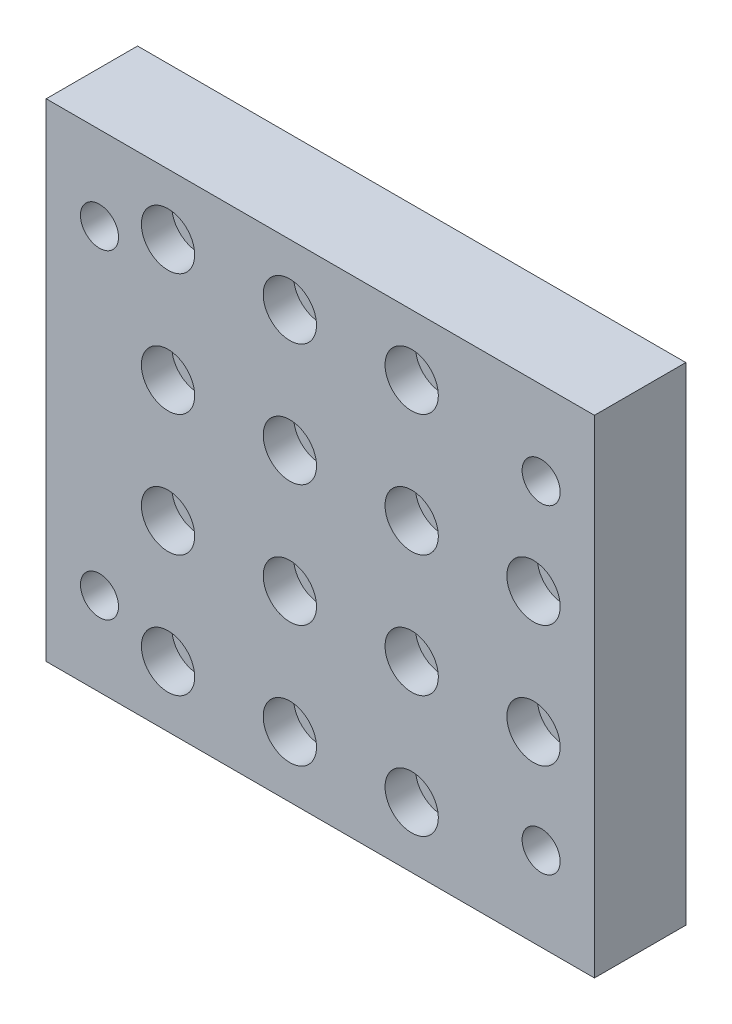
ISO-10303-21;
HEADER;
FILE_DESCRIPTION(('STEP AP214'),'2;1');
FILE_NAME('part.step','',(''),(''),'','','');
FILE_SCHEMA(('AUTOMOTIVE_DESIGN { 1 0 10303 214 1 1 1 1 }'));
ENDSEC;
DATA;
#1=APPLICATION_CONTEXT('core data for automotive mechanical design processes');
#2=APPLICATION_PROTOCOL_DEFINITION('international standard','automotive_design',2000,#1);
#3=PRODUCT_CONTEXT('',#1,'mechanical');
#4=PRODUCT('Part','Part','',(#3));
#5=PRODUCT_RELATED_PRODUCT_CATEGORY('part','',(#4));
#6=PRODUCT_DEFINITION_FORMATION('','',#4);
#7=PRODUCT_DEFINITION_CONTEXT('part definition',#1,'design');
#8=PRODUCT_DEFINITION('design','',#6,#7);
#9=PRODUCT_DEFINITION_SHAPE('','',#8);
#10=(LENGTH_UNIT() NAMED_UNIT(*) SI_UNIT(.MILLI.,.METRE.));
#11=(NAMED_UNIT(*) PLANE_ANGLE_UNIT() SI_UNIT($,.RADIAN.));
#12=(NAMED_UNIT(*) SI_UNIT($,.STERADIAN.) SOLID_ANGLE_UNIT());
#13=UNCERTAINTY_MEASURE_WITH_UNIT(LENGTH_MEASURE(1.E-05),#10,'distance_accuracy_value','');
#14=(GEOMETRIC_REPRESENTATION_CONTEXT(3) GLOBAL_UNCERTAINTY_ASSIGNED_CONTEXT((#13)) GLOBAL_UNIT_ASSIGNED_CONTEXT((#10,
#11,#12)) REPRESENTATION_CONTEXT('',''));
#15=CARTESIAN_POINT('',(0.,0.,0.));
#16=DIRECTION('',(0.,0.,1.));
#17=DIRECTION('',(1.,0.,0.));
#18=AXIS2_PLACEMENT_3D('',#15,#16,#17);
#19=CARTESIAN_POINT('',(-57.15,-50.8,-5.55111512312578E-13));
#20=DIRECTION('',(0.,-1.,0.));
#21=DIRECTION('',(1.,0.,0.));
#22=AXIS2_PLACEMENT_3D('',#19,#20,#21);
#23=PLANE('',#22);
#24=DIRECTION('',(1.,0.,0.));
#25=VECTOR('',#24,1.);
#26=CARTESIAN_POINT('',(-57.15,-50.8,19.049999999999));
#27=LINE('',#26,#25);
#28=CARTESIAN_POINT('',(-57.15,-50.8,19.049999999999));
#29=VERTEX_POINT('',#28);
#30=CARTESIAN_POINT('',(57.15,-50.8,19.049999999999));
#31=VERTEX_POINT('',#30);
#32=EDGE_CURVE('E101',#29,#31,#27,.T.);
#33=ORIENTED_EDGE('',*,*,#32,.F.);
#34=DIRECTION('',(0.,0.,1.));
#35=VECTOR('',#34,1.);
#36=CARTESIAN_POINT('',(-57.15,-50.8,-5.55111512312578E-13));
#37=LINE('',#36,#35);
#38=CARTESIAN_POINT('',(-57.15,-50.8,-5.55111512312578E-13));
#39=VERTEX_POINT('',#38);
#40=EDGE_CURVE('E11',#39,#29,#37,.T.);
#41=ORIENTED_EDGE('',*,*,#40,.F.);
#42=DIRECTION('',(1.,0.,0.));
#43=VECTOR('',#42,1.);
#44=CARTESIAN_POINT('',(-57.15,-50.8,-5.55111512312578E-13));
#45=LINE('',#44,#43);
#46=CARTESIAN_POINT('',(57.15,-50.8,-5.55111512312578E-13));
#47=VERTEX_POINT('',#46);
#48=EDGE_CURVE('E94',#39,#47,#45,.T.);
#49=ORIENTED_EDGE('',*,*,#48,.T.);
#50=DIRECTION('',(0.,0.,1.));
#51=VECTOR('',#50,1.);
#52=CARTESIAN_POINT('',(57.15,-50.8,-5.55111512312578E-13));
#53=LINE('',#52,#51);
#54=EDGE_CURVE('E39',#47,#31,#53,.T.);
#55=ORIENTED_EDGE('',*,*,#54,.T.);
#56=EDGE_LOOP('',(#33,#41,#49,#55));
#57=FACE_BOUND('',#56,.T.);
#58=ADVANCED_FACE('F36',(#57),#23,.T.);
#59=CARTESIAN_POINT('',(-57.15,50.8,-5.55111512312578E-13));
#60=DIRECTION('',(-1.,0.,0.));
#61=DIRECTION('',(0.,-1.,0.));
#62=AXIS2_PLACEMENT_3D('',#59,#60,#61);
#63=PLANE('',#62);
#64=DIRECTION('',(0.,-1.,0.));
#65=VECTOR('',#64,1.);
#66=CARTESIAN_POINT('',(-57.15,50.8,19.0499999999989));
#67=LINE('',#66,#65);
#68=CARTESIAN_POINT('',(-57.15,50.8,19.0499999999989));
#69=VERTEX_POINT('',#68);
#70=EDGE_CURVE('E96',#69,#29,#67,.T.);
#71=ORIENTED_EDGE('',*,*,#70,.F.);
#72=DIRECTION('',(0.,0.,1.));
#73=VECTOR('',#72,1.);
#74=CARTESIAN_POINT('',(-57.15,50.8,-5.55111512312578E-13));
#75=LINE('',#74,#73);
#76=CARTESIAN_POINT('',(-57.15,50.8,-5.55111512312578E-13));
#77=VERTEX_POINT('',#76);
#78=EDGE_CURVE('E45',#77,#69,#75,.T.);
#79=ORIENTED_EDGE('',*,*,#78,.F.);
#80=DIRECTION('',(0.,-1.,0.));
#81=VECTOR('',#80,1.);
#82=CARTESIAN_POINT('',(-57.15,50.8,-5.55111512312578E-13));
#83=LINE('',#82,#81);
#84=EDGE_CURVE('E91',#77,#39,#83,.T.);
#85=ORIENTED_EDGE('',*,*,#84,.T.);
#86=ORIENTED_EDGE('',*,*,#40,.T.);
#87=EDGE_LOOP('',(#71,#79,#85,#86));
#88=FACE_BOUND('',#87,.T.);
#89=ADVANCED_FACE('F112',(#88),#63,.T.);
#90=CARTESIAN_POINT('',(57.15,50.8,-5.55111512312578E-13));
#91=DIRECTION('',(0.,1.,0.));
#92=DIRECTION('',(-1.,0.,0.));
#93=AXIS2_PLACEMENT_3D('',#90,#91,#92);
#94=PLANE('',#93);
#95=DIRECTION('',(-1.,0.,0.));
#96=VECTOR('',#95,1.);
#97=CARTESIAN_POINT('',(57.15,50.8,19.0499999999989));
#98=LINE('',#97,#96);
#99=CARTESIAN_POINT('',(57.15,50.8,19.0499999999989));
#100=VERTEX_POINT('',#99);
#101=EDGE_CURVE('E86',#100,#69,#98,.T.);
#102=ORIENTED_EDGE('',*,*,#101,.F.);
#103=DIRECTION('',(0.,0.,1.));
#104=VECTOR('',#103,1.);
#105=CARTESIAN_POINT('',(57.15,50.8,-5.55111512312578E-13));
#106=LINE('',#105,#104);
#107=CARTESIAN_POINT('',(57.15,50.8,-5.55111512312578E-13));
#108=VERTEX_POINT('',#107);
#109=EDGE_CURVE('E81',#108,#100,#106,.T.);
#110=ORIENTED_EDGE('',*,*,#109,.F.);
#111=DIRECTION('',(-1.,0.,0.));
#112=VECTOR('',#111,1.);
#113=CARTESIAN_POINT('',(57.15,50.8,-5.55111512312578E-13));
#114=LINE('',#113,#112);
#115=EDGE_CURVE('E84',#108,#77,#114,.T.);
#116=ORIENTED_EDGE('',*,*,#115,.T.);
#117=ORIENTED_EDGE('',*,*,#78,.T.);
#118=EDGE_LOOP('',(#102,#110,#116,#117));
#119=FACE_BOUND('',#118,.T.);
#120=ADVANCED_FACE('F83',(#119),#94,.T.);
#121=CARTESIAN_POINT('',(57.15,-50.8,-5.55111512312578E-13));
#122=DIRECTION('',(1.,0.,0.));
#123=DIRECTION('',(0.,0.,-1.));
#124=AXIS2_PLACEMENT_3D('',#121,#122,#123);
#125=PLANE('',#124);
#126=DIRECTION('',(0.,1.,0.));
#127=VECTOR('',#126,1.);
#128=CARTESIAN_POINT('',(57.15,-50.8,19.049999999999));
#129=LINE('',#128,#127);
#130=EDGE_CURVE('E104',#31,#100,#129,.T.);
#131=ORIENTED_EDGE('',*,*,#130,.F.);
#132=ORIENTED_EDGE('',*,*,#54,.F.);
#133=DIRECTION('',(0.,1.,0.));
#134=VECTOR('',#133,1.);
#135=CARTESIAN_POINT('',(57.15,-50.8,-5.55111512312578E-13));
#136=LINE('',#135,#134);
#137=EDGE_CURVE('E90',#47,#108,#136,.T.);
#138=ORIENTED_EDGE('',*,*,#137,.T.);
#139=ORIENTED_EDGE('',*,*,#109,.T.);
#140=EDGE_LOOP('',(#131,#132,#138,#139));
#141=FACE_BOUND('',#140,.T.);
#142=ADVANCED_FACE('F93',(#141),#125,.T.);
#143=CARTESIAN_POINT('',(0.,0.,0.));
#144=DIRECTION('',(0.,0.,1.));
#145=DIRECTION('',(1.,0.,0.));
#146=AXIS2_PLACEMENT_3D('',#143,#144,#145);
#147=PLANE('',#146);
#148=CARTESIAN_POINT('',(-31.75,38.1,-5.55111512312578E-13));
#149=DIRECTION('',(0.,0.,1.));
#150=DIRECTION('',(1.,0.,0.));
#151=AXIS2_PLACEMENT_3D('',#148,#149,#150);
#152=CIRCLE('',#151,3.26389999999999);
#153=CARTESIAN_POINT('',(-28.4861,38.1,-5.55111512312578E-13));
#154=VERTEX_POINT('',#153);
#155=EDGE_CURVE('E332',#154,#154,#152,.T.);
#156=ORIENTED_EDGE('',*,*,#155,.T.);
#157=EDGE_LOOP('',(#156));
#158=FACE_BOUND('',#157,.T.);
#159=CARTESIAN_POINT('',(-6.35000000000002,38.1,-5.55111512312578E-13));
#160=DIRECTION('',(0.,0.,1.));
#161=DIRECTION('',(1.,0.,0.));
#162=AXIS2_PLACEMENT_3D('',#159,#160,#161);
#163=CIRCLE('',#162,3.2639);
#164=CARTESIAN_POINT('',(-3.08610000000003,38.1,-5.55111512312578E-13));
#165=VERTEX_POINT('',#164);
#166=EDGE_CURVE('E343',#165,#165,#163,.T.);
#167=ORIENTED_EDGE('',*,*,#166,.T.);
#168=EDGE_LOOP('',(#167));
#169=FACE_BOUND('',#168,.T.);
#170=CARTESIAN_POINT('',(19.05,38.1,-5.55111512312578E-13));
#171=DIRECTION('',(0.,0.,1.));
#172=DIRECTION('',(1.,0.,0.));
#173=AXIS2_PLACEMENT_3D('',#170,#171,#172);
#174=CIRCLE('',#173,3.26389999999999);
#175=CARTESIAN_POINT('',(22.3139,38.1,-5.55111512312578E-13));
#176=VERTEX_POINT('',#175);
#177=EDGE_CURVE('E355',#176,#176,#174,.T.);
#178=ORIENTED_EDGE('',*,*,#177,.T.);
#179=EDGE_LOOP('',(#178));
#180=FACE_BOUND('',#179,.T.);
#181=CARTESIAN_POINT('',(-31.75,12.7,0.));
#182=DIRECTION('',(0.,0.,1.));
#183=DIRECTION('',(1.,0.,0.));
#184=AXIS2_PLACEMENT_3D('',#181,#182,#183);
#185=CIRCLE('',#184,3.26389999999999);
#186=CARTESIAN_POINT('',(-28.4861,12.7,0.));
#187=VERTEX_POINT('',#186);
#188=EDGE_CURVE('E367',#187,#187,#185,.T.);
#189=ORIENTED_EDGE('',*,*,#188,.T.);
#190=EDGE_LOOP('',(#189));
#191=FACE_BOUND('',#190,.T.);
#192=CARTESIAN_POINT('',(-6.34999999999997,12.7,0.));
#193=DIRECTION('',(0.,0.,1.));
#194=DIRECTION('',(1.,0.,0.));
#195=AXIS2_PLACEMENT_3D('',#192,#193,#194);
#196=CIRCLE('',#195,3.2639);
#197=CARTESIAN_POINT('',(-3.08609999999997,12.7,0.));
#198=VERTEX_POINT('',#197);
#199=EDGE_CURVE('E379',#198,#198,#196,.T.);
#200=ORIENTED_EDGE('',*,*,#199,.T.);
#201=EDGE_LOOP('',(#200));
#202=FACE_BOUND('',#201,.T.);
#203=CARTESIAN_POINT('',(19.05,12.6999999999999,0.));
#204=DIRECTION('',(0.,0.,1.));
#205=DIRECTION('',(1.,0.,0.));
#206=AXIS2_PLACEMENT_3D('',#203,#204,#205);
#207=CIRCLE('',#206,3.26389999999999);
#208=CARTESIAN_POINT('',(22.3139,12.6999999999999,0.));
#209=VERTEX_POINT('',#208);
#210=EDGE_CURVE('E391',#209,#209,#207,.T.);
#211=ORIENTED_EDGE('',*,*,#210,.T.);
#212=EDGE_LOOP('',(#211));
#213=FACE_BOUND('',#212,.T.);
#214=CARTESIAN_POINT('',(-31.75,-12.7,0.));
#215=DIRECTION('',(0.,0.,1.));
#216=DIRECTION('',(1.,0.,0.));
#217=AXIS2_PLACEMENT_3D('',#214,#215,#216);
#218=CIRCLE('',#217,3.26389999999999);
#219=CARTESIAN_POINT('',(-28.4861,-12.7,0.));
#220=VERTEX_POINT('',#219);
#221=EDGE_CURVE('E403',#220,#220,#218,.T.);
#222=ORIENTED_EDGE('',*,*,#221,.T.);
#223=EDGE_LOOP('',(#222));
#224=FACE_BOUND('',#223,.T.);
#225=CARTESIAN_POINT('',(-6.35000000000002,-12.7,0.));
#226=DIRECTION('',(0.,0.,1.));
#227=DIRECTION('',(1.,0.,0.));
#228=AXIS2_PLACEMENT_3D('',#225,#226,#227);
#229=CIRCLE('',#228,3.2639);
#230=CARTESIAN_POINT('',(-3.08610000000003,-12.7,0.));
#231=VERTEX_POINT('',#230);
#232=EDGE_CURVE('E415',#231,#231,#229,.T.);
#233=ORIENTED_EDGE('',*,*,#232,.T.);
#234=EDGE_LOOP('',(#233));
#235=FACE_BOUND('',#234,.T.);
#236=CARTESIAN_POINT('',(-31.75,-38.1,-5.55111512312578E-13));
#237=DIRECTION('',(0.,0.,1.));
#238=DIRECTION('',(1.,0.,0.));
#239=AXIS2_PLACEMENT_3D('',#236,#237,#238);
#240=CIRCLE('',#239,3.26389999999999);
#241=CARTESIAN_POINT('',(-28.4861,-38.1,-5.55111512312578E-13));
#242=VERTEX_POINT('',#241);
#243=EDGE_CURVE('E427',#242,#242,#240,.T.);
#244=ORIENTED_EDGE('',*,*,#243,.T.);
#245=EDGE_LOOP('',(#244));
#246=FACE_BOUND('',#245,.T.);
#247=CARTESIAN_POINT('',(-6.34999999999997,-38.1,-5.55111512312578E-13));
#248=DIRECTION('',(0.,0.,1.));
#249=DIRECTION('',(1.,0.,0.));
#250=AXIS2_PLACEMENT_3D('',#247,#248,#249);
#251=CIRCLE('',#250,3.2639);
#252=CARTESIAN_POINT('',(-3.08609999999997,-38.1,-5.55111512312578E-13));
#253=VERTEX_POINT('',#252);
#254=EDGE_CURVE('E439',#253,#253,#251,.T.);
#255=ORIENTED_EDGE('',*,*,#254,.T.);
#256=EDGE_LOOP('',(#255));
#257=FACE_BOUND('',#256,.T.);
#258=CARTESIAN_POINT('',(44.45,12.7,0.));
#259=DIRECTION('',(0.,0.,1.));
#260=DIRECTION('',(1.,0.,0.));
#261=AXIS2_PLACEMENT_3D('',#258,#259,#260);
#262=CIRCLE('',#261,3.26389999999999);
#263=CARTESIAN_POINT('',(47.7139,12.7,0.));
#264=VERTEX_POINT('',#263);
#265=EDGE_CURVE('E451',#264,#264,#262,.T.);
#266=ORIENTED_EDGE('',*,*,#265,.T.);
#267=EDGE_LOOP('',(#266));
#268=FACE_BOUND('',#267,.T.);
#269=CARTESIAN_POINT('',(19.05,-12.7000000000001,0.));
#270=DIRECTION('',(0.,0.,1.));
#271=DIRECTION('',(1.,0.,0.));
#272=AXIS2_PLACEMENT_3D('',#269,#270,#271);
#273=CIRCLE('',#272,3.26389999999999);
#274=CARTESIAN_POINT('',(22.3139,-12.7000000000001,0.));
#275=VERTEX_POINT('',#274);
#276=EDGE_CURVE('E463',#275,#275,#273,.T.);
#277=ORIENTED_EDGE('',*,*,#276,.T.);
#278=EDGE_LOOP('',(#277));
#279=FACE_BOUND('',#278,.T.);
#280=CARTESIAN_POINT('',(44.45,-12.7,0.));
#281=DIRECTION('',(0.,0.,1.));
#282=DIRECTION('',(1.,0.,0.));
#283=AXIS2_PLACEMENT_3D('',#280,#281,#282);
#284=CIRCLE('',#283,3.26389999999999);
#285=CARTESIAN_POINT('',(47.7139,-12.7,0.));
#286=VERTEX_POINT('',#285);
#287=EDGE_CURVE('E475',#286,#286,#284,.T.);
#288=ORIENTED_EDGE('',*,*,#287,.T.);
#289=EDGE_LOOP('',(#288));
#290=FACE_BOUND('',#289,.T.);
#291=CARTESIAN_POINT('',(19.05,-38.1000000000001,-5.55111512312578E-13));
#292=DIRECTION('',(0.,0.,1.));
#293=DIRECTION('',(1.,0.,0.));
#294=AXIS2_PLACEMENT_3D('',#291,#292,#293);
#295=CIRCLE('',#294,3.26389999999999);
#296=CARTESIAN_POINT('',(22.3139,-38.1000000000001,-5.55111512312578E-13));
#297=VERTEX_POINT('',#296);
#298=EDGE_CURVE('E487',#297,#297,#295,.T.);
#299=ORIENTED_EDGE('',*,*,#298,.T.);
#300=EDGE_LOOP('',(#299));
#301=FACE_BOUND('',#300,.T.);
#302=CARTESIAN_POINT('',(-46.0375,33.3375,-5.55111512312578E-13));
#303=DIRECTION('',(0.,0.,1.));
#304=DIRECTION('',(1.,0.,0.));
#305=AXIS2_PLACEMENT_3D('',#302,#303,#304);
#306=CIRCLE('',#305,3.96874999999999);
#307=CARTESIAN_POINT('',(-42.06875,33.3375,-5.55111512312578E-13));
#308=VERTEX_POINT('',#307);
#309=EDGE_CURVE('E493',#308,#308,#306,.T.);
#310=ORIENTED_EDGE('',*,*,#309,.T.);
#311=EDGE_LOOP('',(#310));
#312=FACE_BOUND('',#311,.T.);
#313=CARTESIAN_POINT('',(46.0375,33.3375,-5.55111512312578E-13));
#314=DIRECTION('',(0.,0.,1.));
#315=DIRECTION('',(1.,0.,0.));
#316=AXIS2_PLACEMENT_3D('',#313,#314,#315);
#317=CIRCLE('',#316,3.96874999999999);
#318=CARTESIAN_POINT('',(50.0062499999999,33.3375,-5.55111512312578E-13));
#319=VERTEX_POINT('',#318);
#320=EDGE_CURVE('E499',#319,#319,#317,.T.);
#321=ORIENTED_EDGE('',*,*,#320,.T.);
#322=EDGE_LOOP('',(#321));
#323=FACE_BOUND('',#322,.T.);
#324=CARTESIAN_POINT('',(46.0375,-33.3375,-5.55111512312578E-13));
#325=DIRECTION('',(0.,0.,1.));
#326=DIRECTION('',(1.,0.,0.));
#327=AXIS2_PLACEMENT_3D('',#324,#325,#326);
#328=CIRCLE('',#327,3.96874999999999);
#329=CARTESIAN_POINT('',(50.00625,-33.3375,-5.55111512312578E-13));
#330=VERTEX_POINT('',#329);
#331=EDGE_CURVE('E505',#330,#330,#328,.T.);
#332=ORIENTED_EDGE('',*,*,#331,.T.);
#333=EDGE_LOOP('',(#332));
#334=FACE_BOUND('',#333,.T.);
#335=CARTESIAN_POINT('',(-46.0375,-33.3375,-5.55111512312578E-13));
#336=DIRECTION('',(0.,0.,1.));
#337=DIRECTION('',(1.,0.,0.));
#338=AXIS2_PLACEMENT_3D('',#335,#336,#337);
#339=CIRCLE('',#338,3.96874999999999);
#340=CARTESIAN_POINT('',(-42.06875,-33.3375,-5.55111512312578E-13));
#341=VERTEX_POINT('',#340);
#342=EDGE_CURVE('E105',#341,#341,#339,.T.);
#343=ORIENTED_EDGE('',*,*,#342,.T.);
#344=EDGE_LOOP('',(#343));
#345=FACE_BOUND('',#344,.T.);
#346=ORIENTED_EDGE('',*,*,#48,.F.);
#347=ORIENTED_EDGE('',*,*,#84,.F.);
#348=ORIENTED_EDGE('',*,*,#115,.F.);
#349=ORIENTED_EDGE('',*,*,#137,.F.);
#350=EDGE_LOOP('',(#346,#347,#348,#349));
#351=FACE_BOUND('',#350,.T.);
#352=ADVANCED_FACE('F89',(#158,#169,#180,#191,#202,#213,#224,#235,#246,#257,#268,#279,#290,#301,
#312,#323,#334,#345,#351),#147,.F.);
#353=CARTESIAN_POINT('',(0.,0.,19.05));
#354=DIRECTION('',(0.,0.,1.));
#355=DIRECTION('',(1.,0.,0.));
#356=AXIS2_PLACEMENT_3D('',#353,#354,#355);
#357=PLANE('',#356);
#358=CARTESIAN_POINT('',(-31.75,38.1,19.0499999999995));
#359=DIRECTION('',(0.,0.,1.));
#360=DIRECTION('',(1.,0.,0.));
#361=AXIS2_PLACEMENT_3D('',#358,#359,#360);
#362=CIRCLE('',#361,5.55625);
#363=CARTESIAN_POINT('',(-26.19375,38.1,19.0499999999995));
#364=VERTEX_POINT('',#363);
#365=EDGE_CURVE('E325',#364,#364,#362,.T.);
#366=ORIENTED_EDGE('',*,*,#365,.F.);
#367=EDGE_LOOP('',(#366));
#368=FACE_BOUND('',#367,.T.);
#369=CARTESIAN_POINT('',(-6.35000000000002,38.1,19.0499999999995));
#370=DIRECTION('',(0.,0.,1.));
#371=DIRECTION('',(1.,0.,0.));
#372=AXIS2_PLACEMENT_3D('',#369,#370,#371);
#373=CIRCLE('',#372,5.55625);
#374=CARTESIAN_POINT('',(-0.793750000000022,38.1,19.0499999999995));
#375=VERTEX_POINT('',#374);
#376=EDGE_CURVE('E334',#375,#375,#373,.T.);
#377=ORIENTED_EDGE('',*,*,#376,.F.);
#378=EDGE_LOOP('',(#377));
#379=FACE_BOUND('',#378,.T.);
#380=CARTESIAN_POINT('',(19.05,38.0999999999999,19.0499999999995));
#381=DIRECTION('',(0.,0.,1.));
#382=DIRECTION('',(1.,0.,0.));
#383=AXIS2_PLACEMENT_3D('',#380,#381,#382);
#384=CIRCLE('',#383,5.55625);
#385=CARTESIAN_POINT('',(24.60625,38.0999999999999,19.0499999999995));
#386=VERTEX_POINT('',#385);
#387=EDGE_CURVE('E346',#386,#386,#384,.T.);
#388=ORIENTED_EDGE('',*,*,#387,.F.);
#389=EDGE_LOOP('',(#388));
#390=FACE_BOUND('',#389,.T.);
#391=CARTESIAN_POINT('',(-31.75,12.7,19.05));
#392=DIRECTION('',(0.,0.,1.));
#393=DIRECTION('',(1.,0.,0.));
#394=AXIS2_PLACEMENT_3D('',#391,#392,#393);
#395=CIRCLE('',#394,5.55625);
#396=CARTESIAN_POINT('',(-26.19375,12.7,19.05));
#397=VERTEX_POINT('',#396);
#398=EDGE_CURVE('E358',#397,#397,#395,.T.);
#399=ORIENTED_EDGE('',*,*,#398,.F.);
#400=EDGE_LOOP('',(#399));
#401=FACE_BOUND('',#400,.T.);
#402=CARTESIAN_POINT('',(-6.34999999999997,12.6999999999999,19.05));
#403=DIRECTION('',(0.,0.,1.));
#404=DIRECTION('',(1.,0.,0.));
#405=AXIS2_PLACEMENT_3D('',#402,#403,#404);
#406=CIRCLE('',#405,5.55625);
#407=CARTESIAN_POINT('',(-0.793749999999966,12.6999999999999,19.05));
#408=VERTEX_POINT('',#407);
#409=EDGE_CURVE('E370',#408,#408,#406,.T.);
#410=ORIENTED_EDGE('',*,*,#409,.F.);
#411=EDGE_LOOP('',(#410));
#412=FACE_BOUND('',#411,.T.);
#413=CARTESIAN_POINT('',(19.05,12.7,19.05));
#414=DIRECTION('',(0.,0.,1.));
#415=DIRECTION('',(1.,0.,0.));
#416=AXIS2_PLACEMENT_3D('',#413,#414,#415);
#417=CIRCLE('',#416,5.55625);
#418=CARTESIAN_POINT('',(24.60625,12.7,19.05));
#419=VERTEX_POINT('',#418);
#420=EDGE_CURVE('E382',#419,#419,#417,.T.);
#421=ORIENTED_EDGE('',*,*,#420,.F.);
#422=EDGE_LOOP('',(#421));
#423=FACE_BOUND('',#422,.T.);
#424=CARTESIAN_POINT('',(-31.75,-12.7,19.05));
#425=DIRECTION('',(0.,0.,1.));
#426=DIRECTION('',(1.,0.,0.));
#427=AXIS2_PLACEMENT_3D('',#424,#425,#426);
#428=CIRCLE('',#427,5.55625);
#429=CARTESIAN_POINT('',(-26.19375,-12.7,19.05));
#430=VERTEX_POINT('',#429);
#431=EDGE_CURVE('E394',#430,#430,#428,.T.);
#432=ORIENTED_EDGE('',*,*,#431,.F.);
#433=EDGE_LOOP('',(#432));
#434=FACE_BOUND('',#433,.T.);
#435=CARTESIAN_POINT('',(-6.35000000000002,-12.7000000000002,19.05));
#436=DIRECTION('',(0.,0.,1.));
#437=DIRECTION('',(1.,0.,0.));
#438=AXIS2_PLACEMENT_3D('',#435,#436,#437);
#439=CIRCLE('',#438,5.55625);
#440=CARTESIAN_POINT('',(-0.793750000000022,-12.7000000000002,19.05));
#441=VERTEX_POINT('',#440);
#442=EDGE_CURVE('E406',#441,#441,#439,.T.);
#443=ORIENTED_EDGE('',*,*,#442,.F.);
#444=EDGE_LOOP('',(#443));
#445=FACE_BOUND('',#444,.T.);
#446=CARTESIAN_POINT('',(-31.75,-38.1000000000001,19.0499999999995));
#447=DIRECTION('',(0.,0.,1.));
#448=DIRECTION('',(1.,0.,0.));
#449=AXIS2_PLACEMENT_3D('',#446,#447,#448);
#450=CIRCLE('',#449,5.55625);
#451=CARTESIAN_POINT('',(-26.19375,-38.1000000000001,19.0499999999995));
#452=VERTEX_POINT('',#451);
#453=EDGE_CURVE('E418',#452,#452,#450,.T.);
#454=ORIENTED_EDGE('',*,*,#453,.F.);
#455=EDGE_LOOP('',(#454));
#456=FACE_BOUND('',#455,.T.);
#457=CARTESIAN_POINT('',(-6.34999999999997,-38.1,19.0499999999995));
#458=DIRECTION('',(0.,0.,1.));
#459=DIRECTION('',(1.,0.,0.));
#460=AXIS2_PLACEMENT_3D('',#457,#458,#459);
#461=CIRCLE('',#460,5.55625);
#462=CARTESIAN_POINT('',(-0.793749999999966,-38.1,19.0499999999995));
#463=VERTEX_POINT('',#462);
#464=EDGE_CURVE('E430',#463,#463,#461,.T.);
#465=ORIENTED_EDGE('',*,*,#464,.F.);
#466=EDGE_LOOP('',(#465));
#467=FACE_BOUND('',#466,.T.);
#468=CARTESIAN_POINT('',(44.45,12.6999999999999,19.05));
#469=DIRECTION('',(0.,0.,1.));
#470=DIRECTION('',(1.,0.,0.));
#471=AXIS2_PLACEMENT_3D('',#468,#469,#470);
#472=CIRCLE('',#471,5.55625);
#473=CARTESIAN_POINT('',(50.00625,12.6999999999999,19.05));
#474=VERTEX_POINT('',#473);
#475=EDGE_CURVE('E442',#474,#474,#472,.T.);
#476=ORIENTED_EDGE('',*,*,#475,.F.);
#477=EDGE_LOOP('',(#476));
#478=FACE_BOUND('',#477,.T.);
#479=CARTESIAN_POINT('',(19.05,-12.7,19.05));
#480=DIRECTION('',(0.,0.,1.));
#481=DIRECTION('',(1.,0.,0.));
#482=AXIS2_PLACEMENT_3D('',#479,#480,#481);
#483=CIRCLE('',#482,5.55625);
#484=CARTESIAN_POINT('',(24.60625,-12.7,19.05));
#485=VERTEX_POINT('',#484);
#486=EDGE_CURVE('E454',#485,#485,#483,.T.);
#487=ORIENTED_EDGE('',*,*,#486,.F.);
#488=EDGE_LOOP('',(#487));
#489=FACE_BOUND('',#488,.T.);
#490=CARTESIAN_POINT('',(44.45,-12.7000000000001,19.05));
#491=DIRECTION('',(0.,0.,1.));
#492=DIRECTION('',(1.,0.,0.));
#493=AXIS2_PLACEMENT_3D('',#490,#491,#492);
#494=CIRCLE('',#493,5.55625);
#495=CARTESIAN_POINT('',(50.00625,-12.7000000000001,19.05));
#496=VERTEX_POINT('',#495);
#497=EDGE_CURVE('E466',#496,#496,#494,.T.);
#498=ORIENTED_EDGE('',*,*,#497,.F.);
#499=EDGE_LOOP('',(#498));
#500=FACE_BOUND('',#499,.T.);
#501=CARTESIAN_POINT('',(19.05,-38.0999999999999,19.0499999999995));
#502=DIRECTION('',(0.,0.,1.));
#503=DIRECTION('',(1.,0.,0.));
#504=AXIS2_PLACEMENT_3D('',#501,#502,#503);
#505=CIRCLE('',#504,5.55625);
#506=CARTESIAN_POINT('',(24.60625,-38.0999999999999,19.0499999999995));
#507=VERTEX_POINT('',#506);
#508=EDGE_CURVE('E478',#507,#507,#505,.T.);
#509=ORIENTED_EDGE('',*,*,#508,.F.);
#510=EDGE_LOOP('',(#509));
#511=FACE_BOUND('',#510,.T.);
#512=CARTESIAN_POINT('',(-46.0375,33.3375,19.0499999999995));
#513=DIRECTION('',(0.,0.,1.));
#514=DIRECTION('',(1.,0.,0.));
#515=AXIS2_PLACEMENT_3D('',#512,#513,#514);
#516=CIRCLE('',#515,3.96874999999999);
#517=CARTESIAN_POINT('',(-42.06875,33.3375,19.0499999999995));
#518=VERTEX_POINT('',#517);
#519=EDGE_CURVE('E490',#518,#518,#516,.T.);
#520=ORIENTED_EDGE('',*,*,#519,.F.);
#521=EDGE_LOOP('',(#520));
#522=FACE_BOUND('',#521,.T.);
#523=CARTESIAN_POINT('',(46.0375,33.3375,19.0499999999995));
#524=DIRECTION('',(0.,0.,1.));
#525=DIRECTION('',(1.,0.,0.));
#526=AXIS2_PLACEMENT_3D('',#523,#524,#525);
#527=CIRCLE('',#526,3.96874999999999);
#528=CARTESIAN_POINT('',(50.0062499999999,33.3375,19.0499999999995));
#529=VERTEX_POINT('',#528);
#530=EDGE_CURVE('E496',#529,#529,#527,.T.);
#531=ORIENTED_EDGE('',*,*,#530,.F.);
#532=EDGE_LOOP('',(#531));
#533=FACE_BOUND('',#532,.T.);
#534=CARTESIAN_POINT('',(46.0375,-33.3375,19.0499999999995));
#535=DIRECTION('',(0.,0.,1.));
#536=DIRECTION('',(1.,0.,0.));
#537=AXIS2_PLACEMENT_3D('',#534,#535,#536);
#538=CIRCLE('',#537,3.96874999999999);
#539=CARTESIAN_POINT('',(50.00625,-33.3375,19.0499999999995));
#540=VERTEX_POINT('',#539);
#541=EDGE_CURVE('E502',#540,#540,#538,.T.);
#542=ORIENTED_EDGE('',*,*,#541,.F.);
#543=EDGE_LOOP('',(#542));
#544=FACE_BOUND('',#543,.T.);
#545=CARTESIAN_POINT('',(-46.0375,-33.3375,19.0499999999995));
#546=DIRECTION('',(0.,0.,1.));
#547=DIRECTION('',(1.,0.,0.));
#548=AXIS2_PLACEMENT_3D('',#545,#546,#547);
#549=CIRCLE('',#548,3.96874999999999);
#550=CARTESIAN_POINT('',(-42.06875,-33.3375,19.0499999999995));
#551=VERTEX_POINT('',#550);
#552=EDGE_CURVE('E508',#551,#551,#549,.T.);
#553=ORIENTED_EDGE('',*,*,#552,.F.);
#554=EDGE_LOOP('',(#553));
#555=FACE_BOUND('',#554,.T.);
#556=ORIENTED_EDGE('',*,*,#32,.T.);
#557=ORIENTED_EDGE('',*,*,#130,.T.);
#558=ORIENTED_EDGE('',*,*,#101,.T.);
#559=ORIENTED_EDGE('',*,*,#70,.T.);
#560=EDGE_LOOP('',(#556,#557,#558,#559));
#561=FACE_BOUND('',#560,.T.);
#562=ADVANCED_FACE('F111',(#368,#379,#390,#401,#412,#423,#434,#445,#456,#467,#478,#489,#500,
#511,#522,#533,#544,#555,#561),#357,.T.);
#563=CARTESIAN_POINT('',(-46.0375,-33.3375,19.0499999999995));
#564=DIRECTION('',(0.,0.,1.));
#565=DIRECTION('',(1.,0.,0.));
#566=AXIS2_PLACEMENT_3D('',#563,#564,#565);
#567=CYLINDRICAL_SURFACE('',#566,3.96874999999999);
#568=ORIENTED_EDGE('',*,*,#342,.F.);
#569=EDGE_LOOP('',(#568));
#570=FACE_BOUND('',#569,.T.);
#571=ORIENTED_EDGE('',*,*,#552,.T.);
#572=EDGE_LOOP('',(#571));
#573=FACE_BOUND('',#572,.T.);
#574=ADVANCED_FACE('F130',(#570,#573),#567,.F.);
#575=CARTESIAN_POINT('',(46.0375,-33.3375,19.0499999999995));
#576=DIRECTION('',(0.,0.,1.));
#577=DIRECTION('',(1.,0.,0.));
#578=AXIS2_PLACEMENT_3D('',#575,#576,#577);
#579=CYLINDRICAL_SURFACE('',#578,3.96874999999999);
#580=ORIENTED_EDGE('',*,*,#331,.F.);
#581=EDGE_LOOP('',(#580));
#582=FACE_BOUND('',#581,.T.);
#583=ORIENTED_EDGE('',*,*,#541,.T.);
#584=EDGE_LOOP('',(#583));
#585=FACE_BOUND('',#584,.T.);
#586=ADVANCED_FACE('F137',(#582,#585),#579,.F.);
#587=CARTESIAN_POINT('',(46.0375,33.3375,19.0499999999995));
#588=DIRECTION('',(0.,0.,1.));
#589=DIRECTION('',(1.,0.,0.));
#590=AXIS2_PLACEMENT_3D('',#587,#588,#589);
#591=CYLINDRICAL_SURFACE('',#590,3.96874999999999);
#592=ORIENTED_EDGE('',*,*,#320,.F.);
#593=EDGE_LOOP('',(#592));
#594=FACE_BOUND('',#593,.T.);
#595=ORIENTED_EDGE('',*,*,#530,.T.);
#596=EDGE_LOOP('',(#595));
#597=FACE_BOUND('',#596,.T.);
#598=ADVANCED_FACE('F141',(#594,#597),#591,.F.);
#599=CARTESIAN_POINT('',(-46.0375,33.3375,19.0499999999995));
#600=DIRECTION('',(0.,0.,1.));
#601=DIRECTION('',(1.,0.,0.));
#602=AXIS2_PLACEMENT_3D('',#599,#600,#601);
#603=CYLINDRICAL_SURFACE('',#602,3.96874999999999);
#604=ORIENTED_EDGE('',*,*,#309,.F.);
#605=EDGE_LOOP('',(#604));
#606=FACE_BOUND('',#605,.T.);
#607=ORIENTED_EDGE('',*,*,#519,.T.);
#608=EDGE_LOOP('',(#607));
#609=FACE_BOUND('',#608,.T.);
#610=ADVANCED_FACE('F145',(#606,#609),#603,.F.);
#611=CARTESIAN_POINT('',(19.05,-38.0999999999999,19.0499999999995));
#612=DIRECTION('',(0.,0.,1.));
#613=DIRECTION('',(1.,0.,0.));
#614=AXIS2_PLACEMENT_3D('',#611,#612,#613);
#615=CYLINDRICAL_SURFACE('',#614,3.2639);
#616=ORIENTED_EDGE('',*,*,#298,.F.);
#617=EDGE_LOOP('',(#616));
#618=FACE_BOUND('',#617,.T.);
#619=CARTESIAN_POINT('',(19.05,-38.1,12.6999999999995));
#620=DIRECTION('',(0.,0.,1.));
#621=DIRECTION('',(1.,0.,0.));
#622=AXIS2_PLACEMENT_3D('',#619,#620,#621);
#623=CIRCLE('',#622,3.2639);
#624=CARTESIAN_POINT('',(22.3139,-38.1,12.6999999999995));
#625=VERTEX_POINT('',#624);
#626=EDGE_CURVE('E484',#625,#625,#623,.T.);
#627=ORIENTED_EDGE('',*,*,#626,.T.);
#628=EDGE_LOOP('',(#627));
#629=FACE_BOUND('',#628,.T.);
#630=ADVANCED_FACE('F149',(#618,#629),#615,.F.);
#631=CARTESIAN_POINT('',(22.3139,-38.1000000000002,12.6999999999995));
#632=DIRECTION('',(0.,0.,-1.));
#633=DIRECTION('',(-1.,0.,0.));
#634=AXIS2_PLACEMENT_3D('',#631,#632,#633);
#635=PLANE('',#634);
#636=ORIENTED_EDGE('',*,*,#626,.F.);
#637=EDGE_LOOP('',(#636));
#638=FACE_BOUND('',#637,.T.);
#639=CARTESIAN_POINT('',(19.05,-38.1,12.6999999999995));
#640=DIRECTION('',(0.,0.,1.));
#641=DIRECTION('',(1.,0.,0.));
#642=AXIS2_PLACEMENT_3D('',#639,#640,#641);
#643=CIRCLE('',#642,5.55625);
#644=CARTESIAN_POINT('',(24.60625,-38.1,12.6999999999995));
#645=VERTEX_POINT('',#644);
#646=EDGE_CURVE('E481',#645,#645,#643,.T.);
#647=ORIENTED_EDGE('',*,*,#646,.T.);
#648=EDGE_LOOP('',(#647));
#649=FACE_BOUND('',#648,.T.);
#650=ADVANCED_FACE('F153',(#638,#649),#635,.F.);
#651=CARTESIAN_POINT('',(19.05,-38.0999999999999,19.0499999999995));
#652=DIRECTION('',(0.,0.,1.));
#653=DIRECTION('',(1.,0.,0.));
#654=AXIS2_PLACEMENT_3D('',#651,#652,#653);
#655=CYLINDRICAL_SURFACE('',#654,5.55625);
#656=ORIENTED_EDGE('',*,*,#646,.F.);
#657=EDGE_LOOP('',(#656));
#658=FACE_BOUND('',#657,.T.);
#659=ORIENTED_EDGE('',*,*,#508,.T.);
#660=EDGE_LOOP('',(#659));
#661=FACE_BOUND('',#660,.T.);
#662=ADVANCED_FACE('F157',(#658,#661),#655,.F.);
#663=CARTESIAN_POINT('',(44.45,-12.7000000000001,19.05));
#664=DIRECTION('',(0.,0.,1.));
#665=DIRECTION('',(1.,0.,0.));
#666=AXIS2_PLACEMENT_3D('',#663,#664,#665);
#667=CYLINDRICAL_SURFACE('',#666,3.2639);
#668=ORIENTED_EDGE('',*,*,#287,.F.);
#669=EDGE_LOOP('',(#668));
#670=FACE_BOUND('',#669,.T.);
#671=CARTESIAN_POINT('',(44.45,-12.7,12.7));
#672=DIRECTION('',(0.,0.,1.));
#673=DIRECTION('',(1.,0.,0.));
#674=AXIS2_PLACEMENT_3D('',#671,#672,#673);
#675=CIRCLE('',#674,3.2639);
#676=CARTESIAN_POINT('',(47.7139,-12.7,12.7));
#677=VERTEX_POINT('',#676);
#678=EDGE_CURVE('E472',#677,#677,#675,.T.);
#679=ORIENTED_EDGE('',*,*,#678,.T.);
#680=EDGE_LOOP('',(#679));
#681=FACE_BOUND('',#680,.T.);
#682=ADVANCED_FACE('F161',(#670,#681),#667,.F.);
#683=CARTESIAN_POINT('',(47.7139,-12.7000000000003,12.7));
#684=DIRECTION('',(0.,0.,-1.));
#685=DIRECTION('',(-1.,0.,0.));
#686=AXIS2_PLACEMENT_3D('',#683,#684,#685);
#687=PLANE('',#686);
#688=ORIENTED_EDGE('',*,*,#678,.F.);
#689=EDGE_LOOP('',(#688));
#690=FACE_BOUND('',#689,.T.);
#691=CARTESIAN_POINT('',(44.45,-12.7,12.7));
#692=DIRECTION('',(0.,0.,1.));
#693=DIRECTION('',(1.,0.,0.));
#694=AXIS2_PLACEMENT_3D('',#691,#692,#693);
#695=CIRCLE('',#694,5.55625);
#696=CARTESIAN_POINT('',(50.00625,-12.7,12.7));
#697=VERTEX_POINT('',#696);
#698=EDGE_CURVE('E469',#697,#697,#695,.T.);
#699=ORIENTED_EDGE('',*,*,#698,.T.);
#700=EDGE_LOOP('',(#699));
#701=FACE_BOUND('',#700,.T.);
#702=ADVANCED_FACE('F165',(#690,#701),#687,.F.);
#703=CARTESIAN_POINT('',(44.45,-12.7000000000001,19.05));
#704=DIRECTION('',(0.,0.,1.));
#705=DIRECTION('',(1.,0.,0.));
#706=AXIS2_PLACEMENT_3D('',#703,#704,#705);
#707=CYLINDRICAL_SURFACE('',#706,5.55625);
#708=ORIENTED_EDGE('',*,*,#698,.F.);
#709=EDGE_LOOP('',(#708));
#710=FACE_BOUND('',#709,.T.);
#711=ORIENTED_EDGE('',*,*,#497,.T.);
#712=EDGE_LOOP('',(#711));
#713=FACE_BOUND('',#712,.T.);
#714=ADVANCED_FACE('F169',(#710,#713),#707,.F.);
#715=CARTESIAN_POINT('',(19.05,-12.7,19.05));
#716=DIRECTION('',(0.,0.,1.));
#717=DIRECTION('',(1.,0.,0.));
#718=AXIS2_PLACEMENT_3D('',#715,#716,#717);
#719=CYLINDRICAL_SURFACE('',#718,3.2639);
#720=ORIENTED_EDGE('',*,*,#276,.F.);
#721=EDGE_LOOP('',(#720));
#722=FACE_BOUND('',#721,.T.);
#723=CARTESIAN_POINT('',(19.05,-12.7,12.7));
#724=DIRECTION('',(0.,0.,1.));
#725=DIRECTION('',(1.,0.,0.));
#726=AXIS2_PLACEMENT_3D('',#723,#724,#725);
#727=CIRCLE('',#726,3.2639);
#728=CARTESIAN_POINT('',(22.3139,-12.7,12.7));
#729=VERTEX_POINT('',#728);
#730=EDGE_CURVE('E460',#729,#729,#727,.T.);
#731=ORIENTED_EDGE('',*,*,#730,.T.);
#732=EDGE_LOOP('',(#731));
#733=FACE_BOUND('',#732,.T.);
#734=ADVANCED_FACE('F173',(#722,#733),#719,.F.);
#735=CARTESIAN_POINT('',(22.3139,-12.7000000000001,12.7));
#736=DIRECTION('',(0.,0.,-1.));
#737=DIRECTION('',(-1.,0.,0.));
#738=AXIS2_PLACEMENT_3D('',#735,#736,#737);
#739=PLANE('',#738);
#740=ORIENTED_EDGE('',*,*,#730,.F.);
#741=EDGE_LOOP('',(#740));
#742=FACE_BOUND('',#741,.T.);
#743=CARTESIAN_POINT('',(19.05,-12.7,12.7));
#744=DIRECTION('',(0.,0.,1.));
#745=DIRECTION('',(1.,0.,0.));
#746=AXIS2_PLACEMENT_3D('',#743,#744,#745);
#747=CIRCLE('',#746,5.55625);
#748=CARTESIAN_POINT('',(24.60625,-12.7,12.7));
#749=VERTEX_POINT('',#748);
#750=EDGE_CURVE('E457',#749,#749,#747,.T.);
#751=ORIENTED_EDGE('',*,*,#750,.T.);
#752=EDGE_LOOP('',(#751));
#753=FACE_BOUND('',#752,.T.);
#754=ADVANCED_FACE('F177',(#742,#753),#739,.F.);
#755=CARTESIAN_POINT('',(19.05,-12.7,19.05));
#756=DIRECTION('',(0.,0.,1.));
#757=DIRECTION('',(1.,0.,0.));
#758=AXIS2_PLACEMENT_3D('',#755,#756,#757);
#759=CYLINDRICAL_SURFACE('',#758,5.55625);
#760=ORIENTED_EDGE('',*,*,#750,.F.);
#761=EDGE_LOOP('',(#760));
#762=FACE_BOUND('',#761,.T.);
#763=ORIENTED_EDGE('',*,*,#486,.T.);
#764=EDGE_LOOP('',(#763));
#765=FACE_BOUND('',#764,.T.);
#766=ADVANCED_FACE('F181',(#762,#765),#759,.F.);
#767=CARTESIAN_POINT('',(44.45,12.6999999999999,19.05));
#768=DIRECTION('',(0.,0.,1.));
#769=DIRECTION('',(1.,0.,0.));
#770=AXIS2_PLACEMENT_3D('',#767,#768,#769);
#771=CYLINDRICAL_SURFACE('',#770,3.2639);
#772=ORIENTED_EDGE('',*,*,#265,.F.);
#773=EDGE_LOOP('',(#772));
#774=FACE_BOUND('',#773,.T.);
#775=CARTESIAN_POINT('',(44.45,12.7,12.6999999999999));
#776=DIRECTION('',(0.,0.,1.));
#777=DIRECTION('',(1.,0.,0.));
#778=AXIS2_PLACEMENT_3D('',#775,#776,#777);
#779=CIRCLE('',#778,3.2639);
#780=CARTESIAN_POINT('',(47.7139,12.7,12.6999999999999));
#781=VERTEX_POINT('',#780);
#782=EDGE_CURVE('E448',#781,#781,#779,.T.);
#783=ORIENTED_EDGE('',*,*,#782,.T.);
#784=EDGE_LOOP('',(#783));
#785=FACE_BOUND('',#784,.T.);
#786=ADVANCED_FACE('F185',(#774,#785),#771,.F.);
#787=CARTESIAN_POINT('',(47.7139,12.6999999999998,12.6999999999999));
#788=DIRECTION('',(0.,0.,-1.));
#789=DIRECTION('',(-1.,0.,0.));
#790=AXIS2_PLACEMENT_3D('',#787,#788,#789);
#791=PLANE('',#790);
#792=ORIENTED_EDGE('',*,*,#782,.F.);
#793=EDGE_LOOP('',(#792));
#794=FACE_BOUND('',#793,.T.);
#795=CARTESIAN_POINT('',(44.45,12.7,12.6999999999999));
#796=DIRECTION('',(0.,0.,1.));
#797=DIRECTION('',(1.,0.,0.));
#798=AXIS2_PLACEMENT_3D('',#795,#796,#797);
#799=CIRCLE('',#798,5.55625);
#800=CARTESIAN_POINT('',(50.00625,12.7,12.6999999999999));
#801=VERTEX_POINT('',#800);
#802=EDGE_CURVE('E445',#801,#801,#799,.T.);
#803=ORIENTED_EDGE('',*,*,#802,.T.);
#804=EDGE_LOOP('',(#803));
#805=FACE_BOUND('',#804,.T.);
#806=ADVANCED_FACE('F189',(#794,#805),#791,.F.);
#807=CARTESIAN_POINT('',(44.45,12.6999999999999,19.05));
#808=DIRECTION('',(0.,0.,1.));
#809=DIRECTION('',(1.,0.,0.));
#810=AXIS2_PLACEMENT_3D('',#807,#808,#809);
#811=CYLINDRICAL_SURFACE('',#810,5.55625);
#812=ORIENTED_EDGE('',*,*,#802,.F.);
#813=EDGE_LOOP('',(#812));
#814=FACE_BOUND('',#813,.T.);
#815=ORIENTED_EDGE('',*,*,#475,.T.);
#816=EDGE_LOOP('',(#815));
#817=FACE_BOUND('',#816,.T.);
#818=ADVANCED_FACE('F193',(#814,#817),#811,.F.);
#819=CARTESIAN_POINT('',(-6.34999999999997,-38.1,19.0499999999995));
#820=DIRECTION('',(0.,0.,1.));
#821=DIRECTION('',(1.,0.,0.));
#822=AXIS2_PLACEMENT_3D('',#819,#820,#821);
#823=CYLINDRICAL_SURFACE('',#822,3.2639);
#824=ORIENTED_EDGE('',*,*,#254,.F.);
#825=EDGE_LOOP('',(#824));
#826=FACE_BOUND('',#825,.T.);
#827=CARTESIAN_POINT('',(-6.34999999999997,-38.1,12.6999999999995));
#828=DIRECTION('',(0.,0.,1.));
#829=DIRECTION('',(1.,0.,0.));
#830=AXIS2_PLACEMENT_3D('',#827,#828,#829);
#831=CIRCLE('',#830,3.2639);
#832=CARTESIAN_POINT('',(-3.08609999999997,-38.1,12.6999999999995));
#833=VERTEX_POINT('',#832);
#834=EDGE_CURVE('E436',#833,#833,#831,.T.);
#835=ORIENTED_EDGE('',*,*,#834,.T.);
#836=EDGE_LOOP('',(#835));
#837=FACE_BOUND('',#836,.T.);
#838=ADVANCED_FACE('F197',(#826,#837),#823,.F.);
#839=CARTESIAN_POINT('',(-3.08609999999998,-38.1,12.6999999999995));
#840=DIRECTION('',(0.,0.,-1.));
#841=DIRECTION('',(-1.,0.,0.));
#842=AXIS2_PLACEMENT_3D('',#839,#840,#841);
#843=PLANE('',#842);
#844=ORIENTED_EDGE('',*,*,#834,.F.);
#845=EDGE_LOOP('',(#844));
#846=FACE_BOUND('',#845,.T.);
#847=CARTESIAN_POINT('',(-6.34999999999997,-38.1,12.6999999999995));
#848=DIRECTION('',(0.,0.,1.));
#849=DIRECTION('',(1.,0.,0.));
#850=AXIS2_PLACEMENT_3D('',#847,#848,#849);
#851=CIRCLE('',#850,5.55625);
#852=CARTESIAN_POINT('',(-0.793749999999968,-38.1,12.6999999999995));
#853=VERTEX_POINT('',#852);
#854=EDGE_CURVE('E433',#853,#853,#851,.T.);
#855=ORIENTED_EDGE('',*,*,#854,.T.);
#856=EDGE_LOOP('',(#855));
#857=FACE_BOUND('',#856,.T.);
#858=ADVANCED_FACE('F201',(#846,#857),#843,.F.);
#859=CARTESIAN_POINT('',(-6.34999999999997,-38.1,19.0499999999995));
#860=DIRECTION('',(0.,0.,1.));
#861=DIRECTION('',(1.,0.,0.));
#862=AXIS2_PLACEMENT_3D('',#859,#860,#861);
#863=CYLINDRICAL_SURFACE('',#862,5.55625);
#864=ORIENTED_EDGE('',*,*,#854,.F.);
#865=EDGE_LOOP('',(#864));
#866=FACE_BOUND('',#865,.T.);
#867=ORIENTED_EDGE('',*,*,#464,.T.);
#868=EDGE_LOOP('',(#867));
#869=FACE_BOUND('',#868,.T.);
#870=ADVANCED_FACE('F205',(#866,#869),#863,.F.);
#871=CARTESIAN_POINT('',(-31.75,-38.1000000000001,19.0499999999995));
#872=DIRECTION('',(0.,0.,1.));
#873=DIRECTION('',(1.,0.,0.));
#874=AXIS2_PLACEMENT_3D('',#871,#872,#873);
#875=CYLINDRICAL_SURFACE('',#874,3.2639);
#876=ORIENTED_EDGE('',*,*,#243,.F.);
#877=EDGE_LOOP('',(#876));
#878=FACE_BOUND('',#877,.T.);
#879=CARTESIAN_POINT('',(-31.75,-38.1000000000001,12.6999999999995));
#880=DIRECTION('',(0.,0.,1.));
#881=DIRECTION('',(1.,0.,0.));
#882=AXIS2_PLACEMENT_3D('',#879,#880,#881);
#883=CIRCLE('',#882,3.2639);
#884=CARTESIAN_POINT('',(-28.4861,-38.1000000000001,12.6999999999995));
#885=VERTEX_POINT('',#884);
#886=EDGE_CURVE('E424',#885,#885,#883,.T.);
#887=ORIENTED_EDGE('',*,*,#886,.T.);
#888=EDGE_LOOP('',(#887));
#889=FACE_BOUND('',#888,.T.);
#890=ADVANCED_FACE('F209',(#878,#889),#875,.F.);
#891=CARTESIAN_POINT('',(-28.4861,-38.1,12.6999999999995));
#892=DIRECTION('',(0.,0.,-1.));
#893=DIRECTION('',(-1.,0.,0.));
#894=AXIS2_PLACEMENT_3D('',#891,#892,#893);
#895=PLANE('',#894);
#896=ORIENTED_EDGE('',*,*,#886,.F.);
#897=EDGE_LOOP('',(#896));
#898=FACE_BOUND('',#897,.T.);
#899=CARTESIAN_POINT('',(-31.75,-38.1000000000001,12.6999999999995));
#900=DIRECTION('',(0.,0.,1.));
#901=DIRECTION('',(1.,0.,0.));
#902=AXIS2_PLACEMENT_3D('',#899,#900,#901);
#903=CIRCLE('',#902,5.55625);
#904=CARTESIAN_POINT('',(-26.19375,-38.1000000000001,12.6999999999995));
#905=VERTEX_POINT('',#904);
#906=EDGE_CURVE('E421',#905,#905,#903,.T.);
#907=ORIENTED_EDGE('',*,*,#906,.T.);
#908=EDGE_LOOP('',(#907));
#909=FACE_BOUND('',#908,.T.);
#910=ADVANCED_FACE('F213',(#898,#909),#895,.F.);
#911=CARTESIAN_POINT('',(-31.75,-38.1000000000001,19.0499999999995));
#912=DIRECTION('',(0.,0.,1.));
#913=DIRECTION('',(1.,0.,0.));
#914=AXIS2_PLACEMENT_3D('',#911,#912,#913);
#915=CYLINDRICAL_SURFACE('',#914,5.55625);
#916=ORIENTED_EDGE('',*,*,#906,.F.);
#917=EDGE_LOOP('',(#916));
#918=FACE_BOUND('',#917,.T.);
#919=ORIENTED_EDGE('',*,*,#453,.T.);
#920=EDGE_LOOP('',(#919));
#921=FACE_BOUND('',#920,.T.);
#922=ADVANCED_FACE('F217',(#918,#921),#915,.F.);
#923=CARTESIAN_POINT('',(-6.35000000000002,-12.7000000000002,19.05));
#924=DIRECTION('',(0.,0.,1.));
#925=DIRECTION('',(1.,0.,0.));
#926=AXIS2_PLACEMENT_3D('',#923,#924,#925);
#927=CYLINDRICAL_SURFACE('',#926,3.2639);
#928=ORIENTED_EDGE('',*,*,#232,.F.);
#929=EDGE_LOOP('',(#928));
#930=FACE_BOUND('',#929,.T.);
#931=CARTESIAN_POINT('',(-6.35000000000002,-12.7,12.7));
#932=DIRECTION('',(0.,0.,1.));
#933=DIRECTION('',(1.,0.,0.));
#934=AXIS2_PLACEMENT_3D('',#931,#932,#933);
#935=CIRCLE('',#934,3.2639);
#936=CARTESIAN_POINT('',(-3.08610000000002,-12.7,12.7));
#937=VERTEX_POINT('',#936);
#938=EDGE_CURVE('E412',#937,#937,#935,.T.);
#939=ORIENTED_EDGE('',*,*,#938,.T.);
#940=EDGE_LOOP('',(#939));
#941=FACE_BOUND('',#940,.T.);
#942=ADVANCED_FACE('F221',(#930,#941),#927,.F.);
#943=CARTESIAN_POINT('',(-3.08610000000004,-12.7,12.7));
#944=DIRECTION('',(0.,0.,-1.));
#945=DIRECTION('',(-1.,0.,0.));
#946=AXIS2_PLACEMENT_3D('',#943,#944,#945);
#947=PLANE('',#946);
#948=ORIENTED_EDGE('',*,*,#938,.F.);
#949=EDGE_LOOP('',(#948));
#950=FACE_BOUND('',#949,.T.);
#951=CARTESIAN_POINT('',(-6.35000000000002,-12.7,12.7));
#952=DIRECTION('',(0.,0.,1.));
#953=DIRECTION('',(1.,0.,0.));
#954=AXIS2_PLACEMENT_3D('',#951,#952,#953);
#955=CIRCLE('',#954,5.55625);
#956=CARTESIAN_POINT('',(-0.793750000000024,-12.7,12.7));
#957=VERTEX_POINT('',#956);
#958=EDGE_CURVE('E409',#957,#957,#955,.T.);
#959=ORIENTED_EDGE('',*,*,#958,.T.);
#960=EDGE_LOOP('',(#959));
#961=FACE_BOUND('',#960,.T.);
#962=ADVANCED_FACE('F225',(#950,#961),#947,.F.);
#963=CARTESIAN_POINT('',(-6.35000000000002,-12.7000000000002,19.05));
#964=DIRECTION('',(0.,0.,1.));
#965=DIRECTION('',(1.,0.,0.));
#966=AXIS2_PLACEMENT_3D('',#963,#964,#965);
#967=CYLINDRICAL_SURFACE('',#966,5.55625);
#968=ORIENTED_EDGE('',*,*,#958,.F.);
#969=EDGE_LOOP('',(#968));
#970=FACE_BOUND('',#969,.T.);
#971=ORIENTED_EDGE('',*,*,#442,.T.);
#972=EDGE_LOOP('',(#971));
#973=FACE_BOUND('',#972,.T.);
#974=ADVANCED_FACE('F229',(#970,#973),#967,.F.);
#975=CARTESIAN_POINT('',(-31.75,-12.7,19.05));
#976=DIRECTION('',(0.,0.,1.));
#977=DIRECTION('',(1.,0.,0.));
#978=AXIS2_PLACEMENT_3D('',#975,#976,#977);
#979=CYLINDRICAL_SURFACE('',#978,3.2639);
#980=ORIENTED_EDGE('',*,*,#221,.F.);
#981=EDGE_LOOP('',(#980));
#982=FACE_BOUND('',#981,.T.);
#983=CARTESIAN_POINT('',(-31.75,-12.7000000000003,12.7));
#984=DIRECTION('',(0.,0.,1.));
#985=DIRECTION('',(1.,0.,0.));
#986=AXIS2_PLACEMENT_3D('',#983,#984,#985);
#987=CIRCLE('',#986,3.2639);
#988=CARTESIAN_POINT('',(-28.4861,-12.7000000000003,12.7));
#989=VERTEX_POINT('',#988);
#990=EDGE_CURVE('E400',#989,#989,#987,.T.);
#991=ORIENTED_EDGE('',*,*,#990,.T.);
#992=EDGE_LOOP('',(#991));
#993=FACE_BOUND('',#992,.T.);
#994=ADVANCED_FACE('F233',(#982,#993),#979,.F.);
#995=CARTESIAN_POINT('',(-28.4861,-12.7,12.7));
#996=DIRECTION('',(0.,0.,-1.));
#997=DIRECTION('',(-1.,0.,0.));
#998=AXIS2_PLACEMENT_3D('',#995,#996,#997);
#999=PLANE('',#998);
#1000=ORIENTED_EDGE('',*,*,#990,.F.);
#1001=EDGE_LOOP('',(#1000));
#1002=FACE_BOUND('',#1001,.T.);
#1003=CARTESIAN_POINT('',(-31.75,-12.7000000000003,12.7));
#1004=DIRECTION('',(0.,0.,1.));
#1005=DIRECTION('',(1.,0.,0.));
#1006=AXIS2_PLACEMENT_3D('',#1003,#1004,#1005);
#1007=CIRCLE('',#1006,5.55625);
#1008=CARTESIAN_POINT('',(-26.19375,-12.7000000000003,12.7));
#1009=VERTEX_POINT('',#1008);
#1010=EDGE_CURVE('E397',#1009,#1009,#1007,.T.);
#1011=ORIENTED_EDGE('',*,*,#1010,.T.);
#1012=EDGE_LOOP('',(#1011));
#1013=FACE_BOUND('',#1012,.T.);
#1014=ADVANCED_FACE('F237',(#1002,#1013),#999,.F.);
#1015=CARTESIAN_POINT('',(-31.75,-12.7,19.05));
#1016=DIRECTION('',(0.,0.,1.));
#1017=DIRECTION('',(1.,0.,0.));
#1018=AXIS2_PLACEMENT_3D('',#1015,#1016,#1017);
#1019=CYLINDRICAL_SURFACE('',#1018,5.55625);
#1020=ORIENTED_EDGE('',*,*,#1010,.F.);
#1021=EDGE_LOOP('',(#1020));
#1022=FACE_BOUND('',#1021,.T.);
#1023=ORIENTED_EDGE('',*,*,#431,.T.);
#1024=EDGE_LOOP('',(#1023));
#1025=FACE_BOUND('',#1024,.T.);
#1026=ADVANCED_FACE('F241',(#1022,#1025),#1019,.F.);
#1027=CARTESIAN_POINT('',(19.05,12.7,19.05));
#1028=DIRECTION('',(0.,0.,1.));
#1029=DIRECTION('',(1.,0.,0.));
#1030=AXIS2_PLACEMENT_3D('',#1027,#1028,#1029);
#1031=CYLINDRICAL_SURFACE('',#1030,3.2639);
#1032=ORIENTED_EDGE('',*,*,#210,.F.);
#1033=EDGE_LOOP('',(#1032));
#1034=FACE_BOUND('',#1033,.T.);
#1035=CARTESIAN_POINT('',(19.05,12.7,12.6999999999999));
#1036=DIRECTION('',(0.,0.,1.));
#1037=DIRECTION('',(1.,0.,0.));
#1038=AXIS2_PLACEMENT_3D('',#1035,#1036,#1037);
#1039=CIRCLE('',#1038,3.2639);
#1040=CARTESIAN_POINT('',(22.3139,12.7,12.6999999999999));
#1041=VERTEX_POINT('',#1040);
#1042=EDGE_CURVE('E388',#1041,#1041,#1039,.T.);
#1043=ORIENTED_EDGE('',*,*,#1042,.T.);
#1044=EDGE_LOOP('',(#1043));
#1045=FACE_BOUND('',#1044,.T.);
#1046=ADVANCED_FACE('F245',(#1034,#1045),#1031,.F.);
#1047=CARTESIAN_POINT('',(22.3139,12.6999999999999,12.6999999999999));
#1048=DIRECTION('',(0.,0.,-1.));
#1049=DIRECTION('',(-1.,0.,0.));
#1050=AXIS2_PLACEMENT_3D('',#1047,#1048,#1049);
#1051=PLANE('',#1050);
#1052=ORIENTED_EDGE('',*,*,#1042,.F.);
#1053=EDGE_LOOP('',(#1052));
#1054=FACE_BOUND('',#1053,.T.);
#1055=CARTESIAN_POINT('',(19.05,12.7,12.6999999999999));
#1056=DIRECTION('',(0.,0.,1.));
#1057=DIRECTION('',(1.,0.,0.));
#1058=AXIS2_PLACEMENT_3D('',#1055,#1056,#1057);
#1059=CIRCLE('',#1058,5.55625);
#1060=CARTESIAN_POINT('',(24.60625,12.7,12.6999999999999));
#1061=VERTEX_POINT('',#1060);
#1062=EDGE_CURVE('E385',#1061,#1061,#1059,.T.);
#1063=ORIENTED_EDGE('',*,*,#1062,.T.);
#1064=EDGE_LOOP('',(#1063));
#1065=FACE_BOUND('',#1064,.T.);
#1066=ADVANCED_FACE('F249',(#1054,#1065),#1051,.F.);
#1067=CARTESIAN_POINT('',(19.05,12.7,19.05));
#1068=DIRECTION('',(0.,0.,1.));
#1069=DIRECTION('',(1.,0.,0.));
#1070=AXIS2_PLACEMENT_3D('',#1067,#1068,#1069);
#1071=CYLINDRICAL_SURFACE('',#1070,5.55625);
#1072=ORIENTED_EDGE('',*,*,#1062,.F.);
#1073=EDGE_LOOP('',(#1072));
#1074=FACE_BOUND('',#1073,.T.);
#1075=ORIENTED_EDGE('',*,*,#420,.T.);
#1076=EDGE_LOOP('',(#1075));
#1077=FACE_BOUND('',#1076,.T.);
#1078=ADVANCED_FACE('F253',(#1074,#1077),#1071,.F.);
#1079=CARTESIAN_POINT('',(-6.34999999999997,12.6999999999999,19.05));
#1080=DIRECTION('',(0.,0.,1.));
#1081=DIRECTION('',(1.,0.,0.));
#1082=AXIS2_PLACEMENT_3D('',#1079,#1080,#1081);
#1083=CYLINDRICAL_SURFACE('',#1082,3.2639);
#1084=ORIENTED_EDGE('',*,*,#199,.F.);
#1085=EDGE_LOOP('',(#1084));
#1086=FACE_BOUND('',#1085,.T.);
#1087=CARTESIAN_POINT('',(-6.34999999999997,12.7,12.6999999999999));
#1088=DIRECTION('',(0.,0.,1.));
#1089=DIRECTION('',(1.,0.,0.));
#1090=AXIS2_PLACEMENT_3D('',#1087,#1088,#1089);
#1091=CIRCLE('',#1090,3.2639);
#1092=CARTESIAN_POINT('',(-3.08609999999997,12.7,12.6999999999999));
#1093=VERTEX_POINT('',#1092);
#1094=EDGE_CURVE('E376',#1093,#1093,#1091,.T.);
#1095=ORIENTED_EDGE('',*,*,#1094,.T.);
#1096=EDGE_LOOP('',(#1095));
#1097=FACE_BOUND('',#1096,.T.);
#1098=ADVANCED_FACE('F257',(#1086,#1097),#1083,.F.);
#1099=CARTESIAN_POINT('',(-3.08609999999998,12.7,12.6999999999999));
#1100=DIRECTION('',(0.,0.,-1.));
#1101=DIRECTION('',(-1.,0.,0.));
#1102=AXIS2_PLACEMENT_3D('',#1099,#1100,#1101);
#1103=PLANE('',#1102);
#1104=ORIENTED_EDGE('',*,*,#1094,.F.);
#1105=EDGE_LOOP('',(#1104));
#1106=FACE_BOUND('',#1105,.T.);
#1107=CARTESIAN_POINT('',(-6.34999999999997,12.7,12.6999999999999));
#1108=DIRECTION('',(0.,0.,1.));
#1109=DIRECTION('',(1.,0.,0.));
#1110=AXIS2_PLACEMENT_3D('',#1107,#1108,#1109);
#1111=CIRCLE('',#1110,5.55625);
#1112=CARTESIAN_POINT('',(-0.793749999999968,12.7,12.6999999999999));
#1113=VERTEX_POINT('',#1112);
#1114=EDGE_CURVE('E373',#1113,#1113,#1111,.T.);
#1115=ORIENTED_EDGE('',*,*,#1114,.T.);
#1116=EDGE_LOOP('',(#1115));
#1117=FACE_BOUND('',#1116,.T.);
#1118=ADVANCED_FACE('F261',(#1106,#1117),#1103,.F.);
#1119=CARTESIAN_POINT('',(-6.34999999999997,12.6999999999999,19.05));
#1120=DIRECTION('',(0.,0.,1.));
#1121=DIRECTION('',(1.,0.,0.));
#1122=AXIS2_PLACEMENT_3D('',#1119,#1120,#1121);
#1123=CYLINDRICAL_SURFACE('',#1122,5.55625);
#1124=ORIENTED_EDGE('',*,*,#1114,.F.);
#1125=EDGE_LOOP('',(#1124));
#1126=FACE_BOUND('',#1125,.T.);
#1127=ORIENTED_EDGE('',*,*,#409,.T.);
#1128=EDGE_LOOP('',(#1127));
#1129=FACE_BOUND('',#1128,.T.);
#1130=ADVANCED_FACE('F265',(#1126,#1129),#1123,.F.);
#1131=CARTESIAN_POINT('',(-31.75,12.7,19.05));
#1132=DIRECTION('',(0.,0.,1.));
#1133=DIRECTION('',(1.,0.,0.));
#1134=AXIS2_PLACEMENT_3D('',#1131,#1132,#1133);
#1135=CYLINDRICAL_SURFACE('',#1134,3.2639);
#1136=ORIENTED_EDGE('',*,*,#188,.F.);
#1137=EDGE_LOOP('',(#1136));
#1138=FACE_BOUND('',#1137,.T.);
#1139=CARTESIAN_POINT('',(-31.75,12.6999999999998,12.6999999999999));
#1140=DIRECTION('',(0.,0.,1.));
#1141=DIRECTION('',(1.,0.,0.));
#1142=AXIS2_PLACEMENT_3D('',#1139,#1140,#1141);
#1143=CIRCLE('',#1142,3.2639);
#1144=CARTESIAN_POINT('',(-28.4861,12.6999999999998,12.6999999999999));
#1145=VERTEX_POINT('',#1144);
#1146=EDGE_CURVE('E364',#1145,#1145,#1143,.T.);
#1147=ORIENTED_EDGE('',*,*,#1146,.T.);
#1148=EDGE_LOOP('',(#1147));
#1149=FACE_BOUND('',#1148,.T.);
#1150=ADVANCED_FACE('F269',(#1138,#1149),#1135,.F.);
#1151=CARTESIAN_POINT('',(-28.4861,12.7,12.6999999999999));
#1152=DIRECTION('',(0.,0.,-1.));
#1153=DIRECTION('',(-1.,0.,0.));
#1154=AXIS2_PLACEMENT_3D('',#1151,#1152,#1153);
#1155=PLANE('',#1154);
#1156=ORIENTED_EDGE('',*,*,#1146,.F.);
#1157=EDGE_LOOP('',(#1156));
#1158=FACE_BOUND('',#1157,.T.);
#1159=CARTESIAN_POINT('',(-31.75,12.6999999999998,12.6999999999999));
#1160=DIRECTION('',(0.,0.,1.));
#1161=DIRECTION('',(1.,0.,0.));
#1162=AXIS2_PLACEMENT_3D('',#1159,#1160,#1161);
#1163=CIRCLE('',#1162,5.55625);
#1164=CARTESIAN_POINT('',(-26.19375,12.6999999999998,12.6999999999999));
#1165=VERTEX_POINT('',#1164);
#1166=EDGE_CURVE('E361',#1165,#1165,#1163,.T.);
#1167=ORIENTED_EDGE('',*,*,#1166,.T.);
#1168=EDGE_LOOP('',(#1167));
#1169=FACE_BOUND('',#1168,.T.);
#1170=ADVANCED_FACE('F273',(#1158,#1169),#1155,.F.);
#1171=CARTESIAN_POINT('',(-31.75,12.7,19.05));
#1172=DIRECTION('',(0.,0.,1.));
#1173=DIRECTION('',(1.,0.,0.));
#1174=AXIS2_PLACEMENT_3D('',#1171,#1172,#1173);
#1175=CYLINDRICAL_SURFACE('',#1174,5.55625);
#1176=ORIENTED_EDGE('',*,*,#1166,.F.);
#1177=EDGE_LOOP('',(#1176));
#1178=FACE_BOUND('',#1177,.T.);
#1179=ORIENTED_EDGE('',*,*,#398,.T.);
#1180=EDGE_LOOP('',(#1179));
#1181=FACE_BOUND('',#1180,.T.);
#1182=ADVANCED_FACE('F277',(#1178,#1181),#1175,.F.);
#1183=CARTESIAN_POINT('',(19.05,38.0999999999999,19.0499999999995));
#1184=DIRECTION('',(0.,0.,1.));
#1185=DIRECTION('',(1.,0.,0.));
#1186=AXIS2_PLACEMENT_3D('',#1183,#1184,#1185);
#1187=CYLINDRICAL_SURFACE('',#1186,3.2639);
#1188=ORIENTED_EDGE('',*,*,#177,.F.);
#1189=EDGE_LOOP('',(#1188));
#1190=FACE_BOUND('',#1189,.T.);
#1191=CARTESIAN_POINT('',(19.05,38.1,12.6999999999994));
#1192=DIRECTION('',(0.,0.,1.));
#1193=DIRECTION('',(1.,0.,0.));
#1194=AXIS2_PLACEMENT_3D('',#1191,#1192,#1193);
#1195=CIRCLE('',#1194,3.2639);
#1196=CARTESIAN_POINT('',(22.3139,38.1,12.6999999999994));
#1197=VERTEX_POINT('',#1196);
#1198=EDGE_CURVE('E352',#1197,#1197,#1195,.T.);
#1199=ORIENTED_EDGE('',*,*,#1198,.T.);
#1200=EDGE_LOOP('',(#1199));
#1201=FACE_BOUND('',#1200,.T.);
#1202=ADVANCED_FACE('F281',(#1190,#1201),#1187,.F.);
#1203=CARTESIAN_POINT('',(22.3139,38.1,12.6999999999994));
#1204=DIRECTION('',(0.,0.,-1.));
#1205=DIRECTION('',(-1.,0.,0.));
#1206=AXIS2_PLACEMENT_3D('',#1203,#1204,#1205);
#1207=PLANE('',#1206);
#1208=ORIENTED_EDGE('',*,*,#1198,.F.);
#1209=EDGE_LOOP('',(#1208));
#1210=FACE_BOUND('',#1209,.T.);
#1211=CARTESIAN_POINT('',(19.05,38.1,12.6999999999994));
#1212=DIRECTION('',(0.,0.,1.));
#1213=DIRECTION('',(1.,0.,0.));
#1214=AXIS2_PLACEMENT_3D('',#1211,#1212,#1213);
#1215=CIRCLE('',#1214,5.55625);
#1216=CARTESIAN_POINT('',(24.60625,38.1,12.6999999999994));
#1217=VERTEX_POINT('',#1216);
#1218=EDGE_CURVE('E349',#1217,#1217,#1215,.T.);
#1219=ORIENTED_EDGE('',*,*,#1218,.T.);
#1220=EDGE_LOOP('',(#1219));
#1221=FACE_BOUND('',#1220,.T.);
#1222=ADVANCED_FACE('F285',(#1210,#1221),#1207,.F.);
#1223=CARTESIAN_POINT('',(19.05,38.0999999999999,19.0499999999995));
#1224=DIRECTION('',(0.,0.,1.));
#1225=DIRECTION('',(1.,0.,0.));
#1226=AXIS2_PLACEMENT_3D('',#1223,#1224,#1225);
#1227=CYLINDRICAL_SURFACE('',#1226,5.55625);
#1228=ORIENTED_EDGE('',*,*,#1218,.F.);
#1229=EDGE_LOOP('',(#1228));
#1230=FACE_BOUND('',#1229,.T.);
#1231=ORIENTED_EDGE('',*,*,#387,.T.);
#1232=EDGE_LOOP('',(#1231));
#1233=FACE_BOUND('',#1232,.T.);
#1234=ADVANCED_FACE('F289',(#1230,#1233),#1227,.F.);
#1235=CARTESIAN_POINT('',(-6.35000000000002,38.1,19.0499999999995));
#1236=DIRECTION('',(0.,0.,1.));
#1237=DIRECTION('',(1.,0.,0.));
#1238=AXIS2_PLACEMENT_3D('',#1235,#1236,#1237);
#1239=CYLINDRICAL_SURFACE('',#1238,3.2639);
#1240=ORIENTED_EDGE('',*,*,#166,.F.);
#1241=EDGE_LOOP('',(#1240));
#1242=FACE_BOUND('',#1241,.T.);
#1243=CARTESIAN_POINT('',(-6.35000000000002,38.1,12.6999999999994));
#1244=DIRECTION('',(0.,0.,1.));
#1245=DIRECTION('',(1.,0.,0.));
#1246=AXIS2_PLACEMENT_3D('',#1243,#1244,#1245);
#1247=CIRCLE('',#1246,3.2639);
#1248=CARTESIAN_POINT('',(-3.08610000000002,38.1,12.6999999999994));
#1249=VERTEX_POINT('',#1248);
#1250=EDGE_CURVE('E340',#1249,#1249,#1247,.T.);
#1251=ORIENTED_EDGE('',*,*,#1250,.T.);
#1252=EDGE_LOOP('',(#1251));
#1253=FACE_BOUND('',#1252,.T.);
#1254=ADVANCED_FACE('F293',(#1242,#1253),#1239,.F.);
#1255=CARTESIAN_POINT('',(-3.08610000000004,38.1,12.6999999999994));
#1256=DIRECTION('',(0.,0.,-1.));
#1257=DIRECTION('',(-1.,0.,0.));
#1258=AXIS2_PLACEMENT_3D('',#1255,#1256,#1257);
#1259=PLANE('',#1258);
#1260=ORIENTED_EDGE('',*,*,#1250,.F.);
#1261=EDGE_LOOP('',(#1260));
#1262=FACE_BOUND('',#1261,.T.);
#1263=CARTESIAN_POINT('',(-6.35000000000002,38.1,12.6999999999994));
#1264=DIRECTION('',(0.,0.,1.));
#1265=DIRECTION('',(1.,0.,0.));
#1266=AXIS2_PLACEMENT_3D('',#1263,#1264,#1265);
#1267=CIRCLE('',#1266,5.55625);
#1268=CARTESIAN_POINT('',(-0.793750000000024,38.1,12.6999999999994));
#1269=VERTEX_POINT('',#1268);
#1270=EDGE_CURVE('E337',#1269,#1269,#1267,.T.);
#1271=ORIENTED_EDGE('',*,*,#1270,.T.);
#1272=EDGE_LOOP('',(#1271));
#1273=FACE_BOUND('',#1272,.T.);
#1274=ADVANCED_FACE('F297',(#1262,#1273),#1259,.F.);
#1275=CARTESIAN_POINT('',(-6.35000000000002,38.1,19.0499999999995));
#1276=DIRECTION('',(0.,0.,1.));
#1277=DIRECTION('',(1.,0.,0.));
#1278=AXIS2_PLACEMENT_3D('',#1275,#1276,#1277);
#1279=CYLINDRICAL_SURFACE('',#1278,5.55625);
#1280=ORIENTED_EDGE('',*,*,#1270,.F.);
#1281=EDGE_LOOP('',(#1280));
#1282=FACE_BOUND('',#1281,.T.);
#1283=ORIENTED_EDGE('',*,*,#376,.T.);
#1284=EDGE_LOOP('',(#1283));
#1285=FACE_BOUND('',#1284,.T.);
#1286=ADVANCED_FACE('F301',(#1282,#1285),#1279,.F.);
#1287=CARTESIAN_POINT('',(-31.75,38.1,19.0499999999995));
#1288=DIRECTION('',(0.,0.,1.));
#1289=DIRECTION('',(1.,0.,0.));
#1290=AXIS2_PLACEMENT_3D('',#1287,#1288,#1289);
#1291=CYLINDRICAL_SURFACE('',#1290,3.2639);
#1292=ORIENTED_EDGE('',*,*,#155,.F.);
#1293=EDGE_LOOP('',(#1292));
#1294=FACE_BOUND('',#1293,.T.);
#1295=CARTESIAN_POINT('',(-31.75,38.0999999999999,12.6999999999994));
#1296=DIRECTION('',(0.,0.,1.));
#1297=DIRECTION('',(1.,0.,0.));
#1298=AXIS2_PLACEMENT_3D('',#1295,#1296,#1297);
#1299=CIRCLE('',#1298,3.2639);
#1300=CARTESIAN_POINT('',(-28.4861,38.0999999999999,12.6999999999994));
#1301=VERTEX_POINT('',#1300);
#1302=EDGE_CURVE('E327',#1301,#1301,#1299,.T.);
#1303=ORIENTED_EDGE('',*,*,#1302,.T.);
#1304=EDGE_LOOP('',(#1303));
#1305=FACE_BOUND('',#1304,.T.);
#1306=ADVANCED_FACE('F305',(#1294,#1305),#1291,.F.);
#1307=CARTESIAN_POINT('',(-28.4861,38.1,12.6999999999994));
#1308=DIRECTION('',(0.,0.,-1.));
#1309=DIRECTION('',(-1.,0.,0.));
#1310=AXIS2_PLACEMENT_3D('',#1307,#1308,#1309);
#1311=PLANE('',#1310);
#1312=ORIENTED_EDGE('',*,*,#1302,.F.);
#1313=EDGE_LOOP('',(#1312));
#1314=FACE_BOUND('',#1313,.T.);
#1315=CARTESIAN_POINT('',(-31.75,38.0999999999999,12.6999999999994));
#1316=DIRECTION('',(0.,0.,1.));
#1317=DIRECTION('',(1.,0.,0.));
#1318=AXIS2_PLACEMENT_3D('',#1315,#1316,#1317);
#1319=CIRCLE('',#1318,5.55625);
#1320=CARTESIAN_POINT('',(-26.19375,38.0999999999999,12.6999999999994));
#1321=VERTEX_POINT('',#1320);
#1322=EDGE_CURVE('E322',#1321,#1321,#1319,.T.);
#1323=ORIENTED_EDGE('',*,*,#1322,.T.);
#1324=EDGE_LOOP('',(#1323));
#1325=FACE_BOUND('',#1324,.T.);
#1326=ADVANCED_FACE('F309',(#1314,#1325),#1311,.F.);
#1327=CARTESIAN_POINT('',(-31.75,38.1,19.0499999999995));
#1328=DIRECTION('',(0.,0.,1.));
#1329=DIRECTION('',(1.,0.,0.));
#1330=AXIS2_PLACEMENT_3D('',#1327,#1328,#1329);
#1331=CYLINDRICAL_SURFACE('',#1330,5.55625);
#1332=ORIENTED_EDGE('',*,*,#1322,.F.);
#1333=EDGE_LOOP('',(#1332));
#1334=FACE_BOUND('',#1333,.T.);
#1335=ORIENTED_EDGE('',*,*,#365,.T.);
#1336=EDGE_LOOP('',(#1335));
#1337=FACE_BOUND('',#1336,.T.);
#1338=ADVANCED_FACE('F313',(#1334,#1337),#1331,.F.);
#1339=CLOSED_SHELL('',(#58,#89,#120,#142,#352,#562,#574,#586,#598,#610,#630,#650,#662,#682,#702,
#714,#734,#754,#766,#786,#806,#818,#838,#858,#870,#890,#910,#922,#942,#962,#974,#994,#1014,
#1026,#1046,#1066,#1078,#1098,#1118,#1130,#1150,#1170,#1182,#1202,#1222,#1234,#1254,#1274,#1286,
#1306,#1326,#1338));
#1340=MANIFOLD_SOLID_BREP('B2',#1339);
#1341=ADVANCED_BREP_SHAPE_REPRESENTATION('',(#18,#1340),#14);
#1342=SHAPE_DEFINITION_REPRESENTATION(#9,#1341);
ENDSEC;
END-ISO-10303-21;
